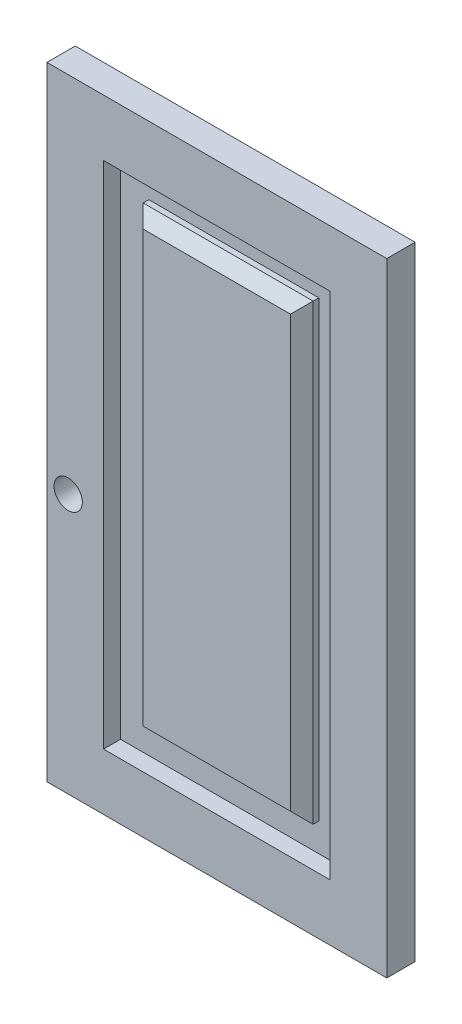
ISO-10303-21;
HEADER;
FILE_DESCRIPTION(('STEP AP214'),'2;1');
FILE_NAME('part.step','',(''),(''),'','','');
FILE_SCHEMA(('AUTOMOTIVE_DESIGN { 1 0 10303 214 1 1 1 1 }'));
ENDSEC;
DATA;
#1=APPLICATION_CONTEXT('core data for automotive mechanical design processes');
#2=APPLICATION_PROTOCOL_DEFINITION('international standard','automotive_design',2000,#1);
#3=PRODUCT_CONTEXT('',#1,'mechanical');
#4=PRODUCT('Part','Part','',(#3));
#5=PRODUCT_RELATED_PRODUCT_CATEGORY('part','',(#4));
#6=PRODUCT_DEFINITION_FORMATION('','',#4);
#7=PRODUCT_DEFINITION_CONTEXT('part definition',#1,'design');
#8=PRODUCT_DEFINITION('design','',#6,#7);
#9=PRODUCT_DEFINITION_SHAPE('','',#8);
#10=(LENGTH_UNIT() NAMED_UNIT(*) SI_UNIT(.MILLI.,.METRE.));
#11=(NAMED_UNIT(*) PLANE_ANGLE_UNIT() SI_UNIT($,.RADIAN.));
#12=(NAMED_UNIT(*) SI_UNIT($,.STERADIAN.) SOLID_ANGLE_UNIT());
#13=UNCERTAINTY_MEASURE_WITH_UNIT(LENGTH_MEASURE(1.E-05),#10,'distance_accuracy_value','');
#14=(GEOMETRIC_REPRESENTATION_CONTEXT(3) GLOBAL_UNCERTAINTY_ASSIGNED_CONTEXT((#13)) GLOBAL_UNIT_ASSIGNED_CONTEXT((#10,
#11,#12)) REPRESENTATION_CONTEXT('',''));
#15=CARTESIAN_POINT('',(0.,0.,0.));
#16=DIRECTION('',(0.,0.,1.));
#17=DIRECTION('',(1.,0.,0.));
#18=AXIS2_PLACEMENT_3D('',#15,#16,#17);
#19=CARTESIAN_POINT('',(0.,0.,-5.));
#20=DIRECTION('',(-1.,0.,0.));
#21=DIRECTION('',(0.,0.,1.));
#22=AXIS2_PLACEMENT_3D('',#19,#20,#21);
#23=PLANE('',#22);
#24=DIRECTION('',(0.,-1.,0.));
#25=VECTOR('',#24,1.);
#26=CARTESIAN_POINT('',(0.,0.,0.));
#27=LINE('',#26,#25);
#28=CARTESIAN_POINT('',(0.,110.,0.));
#29=VERTEX_POINT('',#28);
#30=CARTESIAN_POINT('',(0.,0.,0.));
#31=VERTEX_POINT('',#30);
#32=EDGE_CURVE('E202',#29,#31,#27,.T.);
#33=ORIENTED_EDGE('',*,*,#32,.F.);
#34=DIRECTION('',(0.,0.,1.));
#35=VECTOR('',#34,1.);
#36=CARTESIAN_POINT('',(0.,110.,-5.));
#37=LINE('',#36,#35);
#38=CARTESIAN_POINT('',(0.,110.,-5.));
#39=VERTEX_POINT('',#38);
#40=EDGE_CURVE('E229',#39,#29,#37,.T.);
#41=ORIENTED_EDGE('',*,*,#40,.F.);
#42=DIRECTION('',(0.,-1.,0.));
#43=VECTOR('',#42,1.);
#44=CARTESIAN_POINT('',(0.,0.,-5.));
#45=LINE('',#44,#43);
#46=CARTESIAN_POINT('',(0.,0.,-5.));
#47=VERTEX_POINT('',#46);
#48=EDGE_CURVE('E205',#39,#47,#45,.T.);
#49=ORIENTED_EDGE('',*,*,#48,.T.);
#50=DIRECTION('',(0.,0.,1.));
#51=VECTOR('',#50,1.);
#52=CARTESIAN_POINT('',(0.,0.,-5.));
#53=LINE('',#52,#51);
#54=EDGE_CURVE('E218',#47,#31,#53,.T.);
#55=ORIENTED_EDGE('',*,*,#54,.T.);
#56=EDGE_LOOP('',(#33,#41,#49,#55));
#57=FACE_BOUND('',#56,.T.);
#58=ADVANCED_FACE('F32',(#57),#23,.T.);
#59=CARTESIAN_POINT('',(0.,110.,-5.));
#60=DIRECTION('',(0.,1.,0.));
#61=DIRECTION('',(0.,0.,1.));
#62=AXIS2_PLACEMENT_3D('',#59,#60,#61);
#63=PLANE('',#62);
#64=DIRECTION('',(-1.,0.,0.));
#65=VECTOR('',#64,1.);
#66=CARTESIAN_POINT('',(0.,110.,0.));
#67=LINE('',#66,#65);
#68=CARTESIAN_POINT('',(60.,110.,0.));
#69=VERTEX_POINT('',#68);
#70=EDGE_CURVE('E209',#69,#29,#67,.T.);
#71=ORIENTED_EDGE('',*,*,#70,.F.);
#72=DIRECTION('',(0.,0.,1.));
#73=VECTOR('',#72,1.);
#74=CARTESIAN_POINT('',(60.,110.,-5.));
#75=LINE('',#74,#73);
#76=CARTESIAN_POINT('',(60.,110.,-5.));
#77=VERTEX_POINT('',#76);
#78=EDGE_CURVE('E232',#77,#69,#75,.T.);
#79=ORIENTED_EDGE('',*,*,#78,.F.);
#80=DIRECTION('',(-1.,0.,0.));
#81=VECTOR('',#80,1.);
#82=CARTESIAN_POINT('',(0.,110.,-5.));
#83=LINE('',#82,#81);
#84=EDGE_CURVE('E215',#77,#39,#83,.T.);
#85=ORIENTED_EDGE('',*,*,#84,.T.);
#86=ORIENTED_EDGE('',*,*,#40,.T.);
#87=EDGE_LOOP('',(#71,#79,#85,#86));
#88=FACE_BOUND('',#87,.T.);
#89=ADVANCED_FACE('F282',(#88),#63,.T.);
#90=CARTESIAN_POINT('',(60.,0.,-5.));
#91=DIRECTION('',(1.,0.,0.));
#92=DIRECTION('',(0.,0.,-1.));
#93=AXIS2_PLACEMENT_3D('',#90,#91,#92);
#94=PLANE('',#93);
#95=DIRECTION('',(0.,1.,0.));
#96=VECTOR('',#95,1.);
#97=CARTESIAN_POINT('',(60.,0.,0.));
#98=LINE('',#97,#96);
#99=CARTESIAN_POINT('',(60.,0.,0.));
#100=VERTEX_POINT('',#99);
#101=EDGE_CURVE('E224',#100,#69,#98,.T.);
#102=ORIENTED_EDGE('',*,*,#101,.F.);
#103=DIRECTION('',(0.,0.,1.));
#104=VECTOR('',#103,1.);
#105=CARTESIAN_POINT('',(60.,0.,-5.));
#106=LINE('',#105,#104);
#107=CARTESIAN_POINT('',(60.,0.,-5.));
#108=VERTEX_POINT('',#107);
#109=EDGE_CURVE('E234',#108,#100,#106,.T.);
#110=ORIENTED_EDGE('',*,*,#109,.F.);
#111=DIRECTION('',(0.,1.,0.));
#112=VECTOR('',#111,1.);
#113=CARTESIAN_POINT('',(60.,0.,-5.));
#114=LINE('',#113,#112);
#115=EDGE_CURVE('E212',#108,#77,#114,.T.);
#116=ORIENTED_EDGE('',*,*,#115,.T.);
#117=ORIENTED_EDGE('',*,*,#78,.T.);
#118=EDGE_LOOP('',(#102,#110,#116,#117));
#119=FACE_BOUND('',#118,.T.);
#120=ADVANCED_FACE('F288',(#119),#94,.T.);
#121=CARTESIAN_POINT('',(0.,0.,-5.));
#122=DIRECTION('',(0.,-1.,0.));
#123=DIRECTION('',(0.,0.,-1.));
#124=AXIS2_PLACEMENT_3D('',#121,#122,#123);
#125=PLANE('',#124);
#126=DIRECTION('',(1.,0.,0.));
#127=VECTOR('',#126,1.);
#128=CARTESIAN_POINT('',(0.,0.,0.));
#129=LINE('',#128,#127);
#130=EDGE_CURVE('E221',#31,#100,#129,.T.);
#131=ORIENTED_EDGE('',*,*,#130,.F.);
#132=ORIENTED_EDGE('',*,*,#54,.F.);
#133=DIRECTION('',(1.,0.,0.));
#134=VECTOR('',#133,1.);
#135=CARTESIAN_POINT('',(0.,0.,-5.));
#136=LINE('',#135,#134);
#137=EDGE_CURVE('E208',#47,#108,#136,.T.);
#138=ORIENTED_EDGE('',*,*,#137,.T.);
#139=ORIENTED_EDGE('',*,*,#109,.T.);
#140=EDGE_LOOP('',(#131,#132,#138,#139));
#141=FACE_BOUND('',#140,.T.);
#142=ADVANCED_FACE('F294',(#141),#125,.T.);
#143=CARTESIAN_POINT('',(0.,110.,-5.));
#144=DIRECTION('',(0.,0.,-1.));
#145=DIRECTION('',(-1.,0.,0.));
#146=AXIS2_PLACEMENT_3D('',#143,#144,#145);
#147=PLANE('',#146);
#148=CARTESIAN_POINT('',(3.75599623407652,45.8503306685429,-5.00000000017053));
#149=DIRECTION('',(0.,0.,1.));
#150=DIRECTION('',(1.,0.,0.));
#151=AXIS2_PLACEMENT_3D('',#148,#149,#150);
#152=CIRCLE('',#151,2.5);
#153=CARTESIAN_POINT('',(6.25599623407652,45.8503306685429,-5.00000000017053));
#154=VERTEX_POINT('',#153);
#155=EDGE_CURVE('E199',#154,#154,#152,.T.);
#156=ORIENTED_EDGE('',*,*,#155,.T.);
#157=EDGE_LOOP('',(#156));
#158=FACE_BOUND('',#157,.T.);
#159=ORIENTED_EDGE('',*,*,#48,.F.);
#160=ORIENTED_EDGE('',*,*,#84,.F.);
#161=ORIENTED_EDGE('',*,*,#115,.F.);
#162=ORIENTED_EDGE('',*,*,#137,.F.);
#163=EDGE_LOOP('',(#159,#160,#161,#162));
#164=FACE_BOUND('',#163,.T.);
#165=ADVANCED_FACE('F315',(#158,#164),#147,.T.);
#166=CARTESIAN_POINT('',(0.,110.,0.));
#167=DIRECTION('',(0.,0.,-1.));
#168=DIRECTION('',(-1.,0.,0.));
#169=AXIS2_PLACEMENT_3D('',#166,#167,#168);
#170=PLANE('',#169);
#171=DIRECTION('',(1.,0.,0.));
#172=VECTOR('',#171,1.);
#173=CARTESIAN_POINT('',(10.,10.,0.));
#174=LINE('',#173,#172);
#175=CARTESIAN_POINT('',(10.,9.99999999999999,0.));
#176=VERTEX_POINT('',#175);
#177=CARTESIAN_POINT('',(50.,10.,0.));
#178=VERTEX_POINT('',#177);
#179=EDGE_CURVE('E182',#176,#178,#174,.T.);
#180=ORIENTED_EDGE('',*,*,#179,.F.);
#181=DIRECTION('',(0.,-1.,0.));
#182=VECTOR('',#181,1.);
#183=CARTESIAN_POINT('',(10.,100.,0.));
#184=LINE('',#183,#182);
#185=CARTESIAN_POINT('',(10.,100.,0.));
#186=VERTEX_POINT('',#185);
#187=EDGE_CURVE('E163',#186,#176,#184,.T.);
#188=ORIENTED_EDGE('',*,*,#187,.F.);
#189=DIRECTION('',(-1.,0.,0.));
#190=VECTOR('',#189,1.);
#191=CARTESIAN_POINT('',(10.,100.,0.));
#192=LINE('',#191,#190);
#193=CARTESIAN_POINT('',(50.,100.,0.));
#194=VERTEX_POINT('',#193);
#195=EDGE_CURVE('E171',#194,#186,#192,.T.);
#196=ORIENTED_EDGE('',*,*,#195,.F.);
#197=DIRECTION('',(0.,1.,0.));
#198=VECTOR('',#197,1.);
#199=CARTESIAN_POINT('',(50.,100.,0.));
#200=LINE('',#199,#198);
#201=EDGE_CURVE('E185',#178,#194,#200,.T.);
#202=ORIENTED_EDGE('',*,*,#201,.F.);
#203=EDGE_LOOP('',(#180,#188,#196,#202));
#204=FACE_BOUND('',#203,.T.);
#205=CARTESIAN_POINT('',(3.75599623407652,45.8503306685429,-1.70530256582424E-10));
#206=DIRECTION('',(0.,0.,1.));
#207=DIRECTION('',(1.,0.,0.));
#208=AXIS2_PLACEMENT_3D('',#205,#206,#207);
#209=CIRCLE('',#208,2.5);
#210=CARTESIAN_POINT('',(6.25599623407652,45.8503306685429,-1.70530256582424E-10));
#211=VERTEX_POINT('',#210);
#212=EDGE_CURVE('E192',#211,#211,#209,.T.);
#213=ORIENTED_EDGE('',*,*,#212,.F.);
#214=EDGE_LOOP('',(#213));
#215=FACE_BOUND('',#214,.T.);
#216=ORIENTED_EDGE('',*,*,#32,.T.);
#217=ORIENTED_EDGE('',*,*,#130,.T.);
#218=ORIENTED_EDGE('',*,*,#101,.T.);
#219=ORIENTED_EDGE('',*,*,#70,.T.);
#220=EDGE_LOOP('',(#216,#217,#218,#219));
#221=FACE_BOUND('',#220,.T.);
#222=ADVANCED_FACE('F309',(#204,#215,#221),#170,.F.);
#223=CARTESIAN_POINT('',(3.75599623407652,45.8503306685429,-5.00000000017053));
#224=DIRECTION('',(0.,0.,1.));
#225=DIRECTION('',(1.,0.,0.));
#226=AXIS2_PLACEMENT_3D('',#223,#224,#225);
#227=CYLINDRICAL_SURFACE('',#226,2.5);
#228=ORIENTED_EDGE('',*,*,#155,.F.);
#229=EDGE_LOOP('',(#228));
#230=FACE_BOUND('',#229,.T.);
#231=ORIENTED_EDGE('',*,*,#212,.T.);
#232=EDGE_LOOP('',(#231));
#233=FACE_BOUND('',#232,.T.);
#234=ADVANCED_FACE('F314',(#230,#233),#227,.F.);
#235=CARTESIAN_POINT('',(10.,100.,-3.));
#236=DIRECTION('',(-1.,0.,0.));
#237=DIRECTION('',(0.,0.,1.));
#238=AXIS2_PLACEMENT_3D('',#235,#236,#237);
#239=PLANE('',#238);
#240=ORIENTED_EDGE('',*,*,#187,.T.);
#241=DIRECTION('',(0.,0.,1.));
#242=VECTOR('',#241,1.);
#243=CARTESIAN_POINT('',(10.,10.,-3.));
#244=LINE('',#243,#242);
#245=CARTESIAN_POINT('',(10.,10.,-3.));
#246=VERTEX_POINT('',#245);
#247=EDGE_CURVE('E180',#246,#176,#244,.T.);
#248=ORIENTED_EDGE('',*,*,#247,.F.);
#249=DIRECTION('',(0.,-1.,0.));
#250=VECTOR('',#249,1.);
#251=CARTESIAN_POINT('',(10.,100.,-3.));
#252=LINE('',#251,#250);
#253=CARTESIAN_POINT('',(10.,100.,-3.));
#254=VERTEX_POINT('',#253);
#255=EDGE_CURVE('E167',#254,#246,#252,.T.);
#256=ORIENTED_EDGE('',*,*,#255,.F.);
#257=DIRECTION('',(0.,0.,1.));
#258=VECTOR('',#257,1.);
#259=CARTESIAN_POINT('',(10.,100.,-3.));
#260=LINE('',#259,#258);
#261=EDGE_CURVE('E190',#254,#186,#260,.T.);
#262=ORIENTED_EDGE('',*,*,#261,.T.);
#263=EDGE_LOOP('',(#240,#248,#256,#262));
#264=FACE_BOUND('',#263,.T.);
#265=ADVANCED_FACE('F321',(#264),#239,.F.);
#266=CARTESIAN_POINT('',(10.,100.,-3.));
#267=DIRECTION('',(0.,1.,0.));
#268=DIRECTION('',(0.,0.,1.));
#269=AXIS2_PLACEMENT_3D('',#266,#267,#268);
#270=PLANE('',#269);
#271=ORIENTED_EDGE('',*,*,#195,.T.);
#272=ORIENTED_EDGE('',*,*,#261,.F.);
#273=DIRECTION('',(-1.,0.,0.));
#274=VECTOR('',#273,1.);
#275=CARTESIAN_POINT('',(10.,100.,-3.));
#276=LINE('',#275,#274);
#277=CARTESIAN_POINT('',(50.,100.,-3.));
#278=VERTEX_POINT('',#277);
#279=EDGE_CURVE('E177',#278,#254,#276,.T.);
#280=ORIENTED_EDGE('',*,*,#279,.F.);
#281=DIRECTION('',(0.,0.,1.));
#282=VECTOR('',#281,1.);
#283=CARTESIAN_POINT('',(50.,100.,-3.));
#284=LINE('',#283,#282);
#285=EDGE_CURVE('E193',#278,#194,#284,.T.);
#286=ORIENTED_EDGE('',*,*,#285,.T.);
#287=EDGE_LOOP('',(#271,#272,#280,#286));
#288=FACE_BOUND('',#287,.T.);
#289=ADVANCED_FACE('F371',(#288),#270,.F.);
#290=CARTESIAN_POINT('',(50.,100.,-3.));
#291=DIRECTION('',(1.,0.,0.));
#292=DIRECTION('',(0.,0.,-1.));
#293=AXIS2_PLACEMENT_3D('',#290,#291,#292);
#294=PLANE('',#293);
#295=ORIENTED_EDGE('',*,*,#201,.T.);
#296=ORIENTED_EDGE('',*,*,#285,.F.);
#297=DIRECTION('',(0.,1.,0.));
#298=VECTOR('',#297,1.);
#299=CARTESIAN_POINT('',(50.,100.,-3.));
#300=LINE('',#299,#298);
#301=CARTESIAN_POINT('',(50.,10.,-3.));
#302=VERTEX_POINT('',#301);
#303=EDGE_CURVE('E174',#302,#278,#300,.T.);
#304=ORIENTED_EDGE('',*,*,#303,.F.);
#305=DIRECTION('',(0.,0.,1.));
#306=VECTOR('',#305,1.);
#307=CARTESIAN_POINT('',(50.,10.,-3.));
#308=LINE('',#307,#306);
#309=EDGE_CURVE('E195',#302,#178,#308,.T.);
#310=ORIENTED_EDGE('',*,*,#309,.T.);
#311=EDGE_LOOP('',(#295,#296,#304,#310));
#312=FACE_BOUND('',#311,.T.);
#313=ADVANCED_FACE('F381',(#312),#294,.F.);
#314=CARTESIAN_POINT('',(10.,10.,-3.));
#315=DIRECTION('',(0.,-1.,0.));
#316=DIRECTION('',(0.,0.,-1.));
#317=AXIS2_PLACEMENT_3D('',#314,#315,#316);
#318=PLANE('',#317);
#319=ORIENTED_EDGE('',*,*,#179,.T.);
#320=ORIENTED_EDGE('',*,*,#309,.F.);
#321=DIRECTION('',(1.,0.,0.));
#322=VECTOR('',#321,1.);
#323=CARTESIAN_POINT('',(10.,10.,-3.));
#324=LINE('',#323,#322);
#325=EDGE_CURVE('E170',#246,#302,#324,.T.);
#326=ORIENTED_EDGE('',*,*,#325,.F.);
#327=ORIENTED_EDGE('',*,*,#247,.T.);
#328=EDGE_LOOP('',(#319,#320,#326,#327));
#329=FACE_BOUND('',#328,.T.);
#330=ADVANCED_FACE('F391',(#329),#318,.F.);
#331=CARTESIAN_POINT('',(10.,10.,-3.));
#332=DIRECTION('',(0.,0.,1.));
#333=DIRECTION('',(1.,0.,0.));
#334=AXIS2_PLACEMENT_3D('',#331,#332,#333);
#335=PLANE('',#334);
#336=DIRECTION('',(0.,1.,0.));
#337=VECTOR('',#336,1.);
#338=CARTESIAN_POINT('',(45.,95.,-3.));
#339=LINE('',#338,#337);
#340=CARTESIAN_POINT('',(45.,15.,-3.));
#341=VERTEX_POINT('',#340);
#342=CARTESIAN_POINT('',(45.,95.,-3.));
#343=VERTEX_POINT('',#342);
#344=EDGE_CURVE('E141',#341,#343,#339,.T.);
#345=ORIENTED_EDGE('',*,*,#344,.F.);
#346=DIRECTION('',(1.,0.,0.));
#347=VECTOR('',#346,1.);
#348=CARTESIAN_POINT('',(15.,15.,-3.));
#349=LINE('',#348,#347);
#350=CARTESIAN_POINT('',(15.,15.,-3.));
#351=VERTEX_POINT('',#350);
#352=EDGE_CURVE('E151',#351,#341,#349,.T.);
#353=ORIENTED_EDGE('',*,*,#352,.F.);
#354=DIRECTION('',(0.,-1.,0.));
#355=VECTOR('',#354,1.);
#356=CARTESIAN_POINT('',(15.,95.,-3.));
#357=LINE('',#356,#355);
#358=CARTESIAN_POINT('',(15.,95.,-3.));
#359=VERTEX_POINT('',#358);
#360=EDGE_CURVE('E136',#359,#351,#357,.T.);
#361=ORIENTED_EDGE('',*,*,#360,.F.);
#362=DIRECTION('',(-1.,0.,0.));
#363=VECTOR('',#362,1.);
#364=CARTESIAN_POINT('',(15.,95.,-3.));
#365=LINE('',#364,#363);
#366=EDGE_CURVE('E148',#343,#359,#365,.T.);
#367=ORIENTED_EDGE('',*,*,#366,.F.);
#368=EDGE_LOOP('',(#345,#353,#361,#367));
#369=FACE_BOUND('',#368,.T.);
#370=ORIENTED_EDGE('',*,*,#255,.T.);
#371=ORIENTED_EDGE('',*,*,#325,.T.);
#372=ORIENTED_EDGE('',*,*,#303,.T.);
#373=ORIENTED_EDGE('',*,*,#279,.T.);
#374=EDGE_LOOP('',(#370,#371,#372,#373));
#375=FACE_BOUND('',#374,.T.);
#376=ADVANCED_FACE('F146',(#369,#375),#335,.T.);
#377=CARTESIAN_POINT('',(15.,95.,-3.));
#378=DIRECTION('',(0.,1.,0.));
#379=DIRECTION('',(0.,0.,1.));
#380=AXIS2_PLACEMENT_3D('',#377,#378,#379);
#381=PLANE('',#380);
#382=DIRECTION('',(0.,0.,1.));
#383=VECTOR('',#382,1.);
#384=CARTESIAN_POINT('',(15.,95.,-3.));
#385=LINE('',#384,#383);
#386=CARTESIAN_POINT('',(15.,95.,-2.00000000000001));
#387=VERTEX_POINT('',#386);
#388=EDGE_CURVE('E133',#359,#387,#385,.T.);
#389=ORIENTED_EDGE('',*,*,#388,.T.);
#390=DIRECTION('',(1.,0.,0.));
#391=VECTOR('',#390,1.);
#392=CARTESIAN_POINT('',(45.,95.,-2.00000000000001));
#393=LINE('',#392,#391);
#394=CARTESIAN_POINT('',(45.,95.,-2.00000000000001));
#395=VERTEX_POINT('',#394);
#396=EDGE_CURVE('E11',#387,#395,#393,.T.);
#397=ORIENTED_EDGE('',*,*,#396,.T.);
#398=DIRECTION('',(0.,0.,1.));
#399=VECTOR('',#398,1.);
#400=CARTESIAN_POINT('',(45.,95.,-3.));
#401=LINE('',#400,#399);
#402=EDGE_CURVE('E155',#343,#395,#401,.T.);
#403=ORIENTED_EDGE('',*,*,#402,.F.);
#404=ORIENTED_EDGE('',*,*,#366,.T.);
#405=EDGE_LOOP('',(#389,#397,#403,#404));
#406=FACE_BOUND('',#405,.T.);
#407=ADVANCED_FACE('F153',(#406),#381,.T.);
#408=CARTESIAN_POINT('',(45.,95.,-3.));
#409=DIRECTION('',(1.,0.,0.));
#410=DIRECTION('',(0.,0.,-1.));
#411=AXIS2_PLACEMENT_3D('',#408,#409,#410);
#412=PLANE('',#411);
#413=ORIENTED_EDGE('',*,*,#402,.T.);
#414=DIRECTION('',(0.,-1.,0.));
#415=VECTOR('',#414,1.);
#416=CARTESIAN_POINT('',(45.,15.,-2.00000000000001));
#417=LINE('',#416,#415);
#418=CARTESIAN_POINT('',(45.,15.,-2.00000000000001));
#419=VERTEX_POINT('',#418);
#420=EDGE_CURVE('E245',#395,#419,#417,.T.);
#421=ORIENTED_EDGE('',*,*,#420,.T.);
#422=DIRECTION('',(0.,0.,1.));
#423=VECTOR('',#422,1.);
#424=CARTESIAN_POINT('',(45.,15.,-3.));
#425=LINE('',#424,#423);
#426=EDGE_CURVE('E164',#341,#419,#425,.T.);
#427=ORIENTED_EDGE('',*,*,#426,.F.);
#428=ORIENTED_EDGE('',*,*,#344,.T.);
#429=EDGE_LOOP('',(#413,#421,#427,#428));
#430=FACE_BOUND('',#429,.T.);
#431=ADVANCED_FACE('F271',(#430),#412,.T.);
#432=CARTESIAN_POINT('',(15.,15.,-3.));
#433=DIRECTION('',(0.,-1.,0.));
#434=DIRECTION('',(0.,0.,-1.));
#435=AXIS2_PLACEMENT_3D('',#432,#433,#434);
#436=PLANE('',#435);
#437=ORIENTED_EDGE('',*,*,#426,.T.);
#438=DIRECTION('',(-1.,0.,0.));
#439=VECTOR('',#438,1.);
#440=CARTESIAN_POINT('',(15.,15.,-2.00000000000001));
#441=LINE('',#440,#439);
#442=CARTESIAN_POINT('',(15.,15.,-2.00000000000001));
#443=VERTEX_POINT('',#442);
#444=EDGE_CURVE('E56',#419,#443,#441,.T.);
#445=ORIENTED_EDGE('',*,*,#444,.T.);
#446=DIRECTION('',(0.,0.,1.));
#447=VECTOR('',#446,1.);
#448=CARTESIAN_POINT('',(15.,15.,-3.));
#449=LINE('',#448,#447);
#450=EDGE_CURVE('E140',#351,#443,#449,.T.);
#451=ORIENTED_EDGE('',*,*,#450,.F.);
#452=ORIENTED_EDGE('',*,*,#352,.T.);
#453=EDGE_LOOP('',(#437,#445,#451,#452));
#454=FACE_BOUND('',#453,.T.);
#455=ADVANCED_FACE('F272',(#454),#436,.T.);
#456=CARTESIAN_POINT('',(15.,95.,-3.));
#457=DIRECTION('',(-1.,0.,0.));
#458=DIRECTION('',(0.,0.,1.));
#459=AXIS2_PLACEMENT_3D('',#456,#457,#458);
#460=PLANE('',#459);
#461=ORIENTED_EDGE('',*,*,#450,.T.);
#462=DIRECTION('',(0.,1.,0.));
#463=VECTOR('',#462,1.);
#464=CARTESIAN_POINT('',(15.,95.,-2.00000000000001));
#465=LINE('',#464,#463);
#466=EDGE_CURVE('E41',#443,#387,#465,.T.);
#467=ORIENTED_EDGE('',*,*,#466,.T.);
#468=ORIENTED_EDGE('',*,*,#388,.F.);
#469=ORIENTED_EDGE('',*,*,#360,.T.);
#470=EDGE_LOOP('',(#461,#467,#468,#469));
#471=FACE_BOUND('',#470,.T.);
#472=ADVANCED_FACE('F135',(#471),#460,.T.);
#473=DIRECTION('',(1.,0.,0.));
#474=VECTOR('',#473,1.);
#475=CARTESIAN_POINT('',(45.,17.,0.));
#476=LINE('',#475,#474);
#477=CARTESIAN_POINT('',(17.,17.,0.));
#478=VERTEX_POINT('',#477);
#479=CARTESIAN_POINT('',(43.,17.,0.));
#480=VERTEX_POINT('',#479);
#481=EDGE_CURVE('E240',#478,#480,#476,.T.);
#482=ORIENTED_EDGE('',*,*,#481,.T.);
#483=DIRECTION('',(0.,1.,0.));
#484=VECTOR('',#483,1.);
#485=CARTESIAN_POINT('',(43.,95.,0.));
#486=LINE('',#485,#484);
#487=CARTESIAN_POINT('',(43.,93.,0.));
#488=VERTEX_POINT('',#487);
#489=EDGE_CURVE('E242',#480,#488,#486,.T.);
#490=ORIENTED_EDGE('',*,*,#489,.T.);
#491=DIRECTION('',(-1.,0.,0.));
#492=VECTOR('',#491,1.);
#493=CARTESIAN_POINT('',(15.,93.,0.));
#494=LINE('',#493,#492);
#495=CARTESIAN_POINT('',(17.,93.,0.));
#496=VERTEX_POINT('',#495);
#497=EDGE_CURVE('E231',#488,#496,#494,.T.);
#498=ORIENTED_EDGE('',*,*,#497,.T.);
#499=DIRECTION('',(0.,-1.,0.));
#500=VECTOR('',#499,1.);
#501=CARTESIAN_POINT('',(17.,15.,0.));
#502=LINE('',#501,#500);
#503=EDGE_CURVE('E238',#496,#478,#502,.T.);
#504=ORIENTED_EDGE('',*,*,#503,.T.);
#505=EDGE_LOOP('',(#482,#490,#498,#504));
#506=FACE_BOUND('',#505,.T.);
#507=ADVANCED_FACE('F264',(#506),#170,.F.);
#508=CARTESIAN_POINT('',(17.,110.,0.));
#509=DIRECTION('',(-0.707106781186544,0.,0.707106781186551));
#510=DIRECTION('',(0.707106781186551,0.,0.707106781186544));
#511=AXIS2_PLACEMENT_3D('',#508,#509,#510);
#512=PLANE('',#511);
#513=DIRECTION('',(0.577350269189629,-0.577350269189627,0.577350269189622));
#514=VECTOR('',#513,1.);
#515=CARTESIAN_POINT('',(11.3333333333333,98.6666666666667,-5.66666666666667));
#516=LINE('',#515,#514);
#517=EDGE_CURVE('E158',#387,#496,#516,.T.);
#518=ORIENTED_EDGE('',*,*,#517,.F.);
#519=ORIENTED_EDGE('',*,*,#466,.F.);
#520=DIRECTION('',(0.577350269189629,0.577350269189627,0.577350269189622));
#521=VECTOR('',#520,1.);
#522=CARTESIAN_POINT('',(48.0000000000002,48.0000000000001,30.9999999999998));
#523=LINE('',#522,#521);
#524=EDGE_CURVE('E36',#478,#443,#523,.F.);
#525=ORIENTED_EDGE('',*,*,#524,.F.);
#526=ORIENTED_EDGE('',*,*,#503,.F.);
#527=EDGE_LOOP('',(#518,#519,#525,#526));
#528=FACE_BOUND('',#527,.T.);
#529=ADVANCED_FACE('F34',(#528),#512,.T.);
#530=CARTESIAN_POINT('',(0.,17.,0.));
#531=DIRECTION('',(0.,-0.707106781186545,0.70710678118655));
#532=DIRECTION('',(0.,-0.70710678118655,-0.707106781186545));
#533=AXIS2_PLACEMENT_3D('',#530,#531,#532);
#534=PLANE('',#533);
#535=ORIENTED_EDGE('',*,*,#524,.T.);
#536=ORIENTED_EDGE('',*,*,#444,.F.);
#537=DIRECTION('',(-0.577350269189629,0.577350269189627,0.577350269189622));
#538=VECTOR('',#537,1.);
#539=CARTESIAN_POINT('',(28.6666666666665,31.3333333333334,14.3333333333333));
#540=LINE('',#539,#538);
#541=EDGE_CURVE('E252',#480,#419,#540,.F.);
#542=ORIENTED_EDGE('',*,*,#541,.F.);
#543=ORIENTED_EDGE('',*,*,#481,.F.);
#544=EDGE_LOOP('',(#535,#536,#542,#543));
#545=FACE_BOUND('',#544,.T.);
#546=ADVANCED_FACE('F299',(#545),#534,.T.);
#547=CARTESIAN_POINT('',(0.,93.,0.));
#548=DIRECTION('',(0.,0.707106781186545,0.70710678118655));
#549=DIRECTION('',(0.,-0.70710678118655,0.707106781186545));
#550=AXIS2_PLACEMENT_3D('',#547,#548,#549);
#551=PLANE('',#550);
#552=ORIENTED_EDGE('',*,*,#517,.T.);
#553=ORIENTED_EDGE('',*,*,#497,.F.);
#554=DIRECTION('',(0.577350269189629,0.577350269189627,-0.577350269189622));
#555=VECTOR('',#554,1.);
#556=CARTESIAN_POINT('',(28.6666666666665,78.6666666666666,14.3333333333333));
#557=LINE('',#556,#555);
#558=EDGE_CURVE('E250',#395,#488,#557,.F.);
#559=ORIENTED_EDGE('',*,*,#558,.F.);
#560=ORIENTED_EDGE('',*,*,#396,.F.);
#561=EDGE_LOOP('',(#552,#553,#559,#560));
#562=FACE_BOUND('',#561,.T.);
#563=ADVANCED_FACE('F257',(#562),#551,.T.);
#564=CARTESIAN_POINT('',(43.,110.,0.));
#565=DIRECTION('',(0.707106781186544,0.,0.707106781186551));
#566=DIRECTION('',(0.707106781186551,0.,-0.707106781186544));
#567=AXIS2_PLACEMENT_3D('',#564,#565,#566);
#568=PLANE('',#567);
#569=ORIENTED_EDGE('',*,*,#541,.T.);
#570=ORIENTED_EDGE('',*,*,#420,.F.);
#571=ORIENTED_EDGE('',*,*,#558,.T.);
#572=ORIENTED_EDGE('',*,*,#489,.F.);
#573=EDGE_LOOP('',(#569,#570,#571,#572));
#574=FACE_BOUND('',#573,.T.);
#575=ADVANCED_FACE('F268',(#574),#568,.T.);
#576=CLOSED_SHELL('',(#58,#89,#120,#142,#165,#222,#234,#265,#289,#313,#330,#376,#407,#431,#455,
#472,#507,#529,#546,#563,#575));
#577=MANIFOLD_SOLID_BREP('B2',#576);
#578=ADVANCED_BREP_SHAPE_REPRESENTATION('',(#18,#577),#14);
#579=SHAPE_DEFINITION_REPRESENTATION(#9,#578);
ENDSEC;
END-ISO-10303-21;
